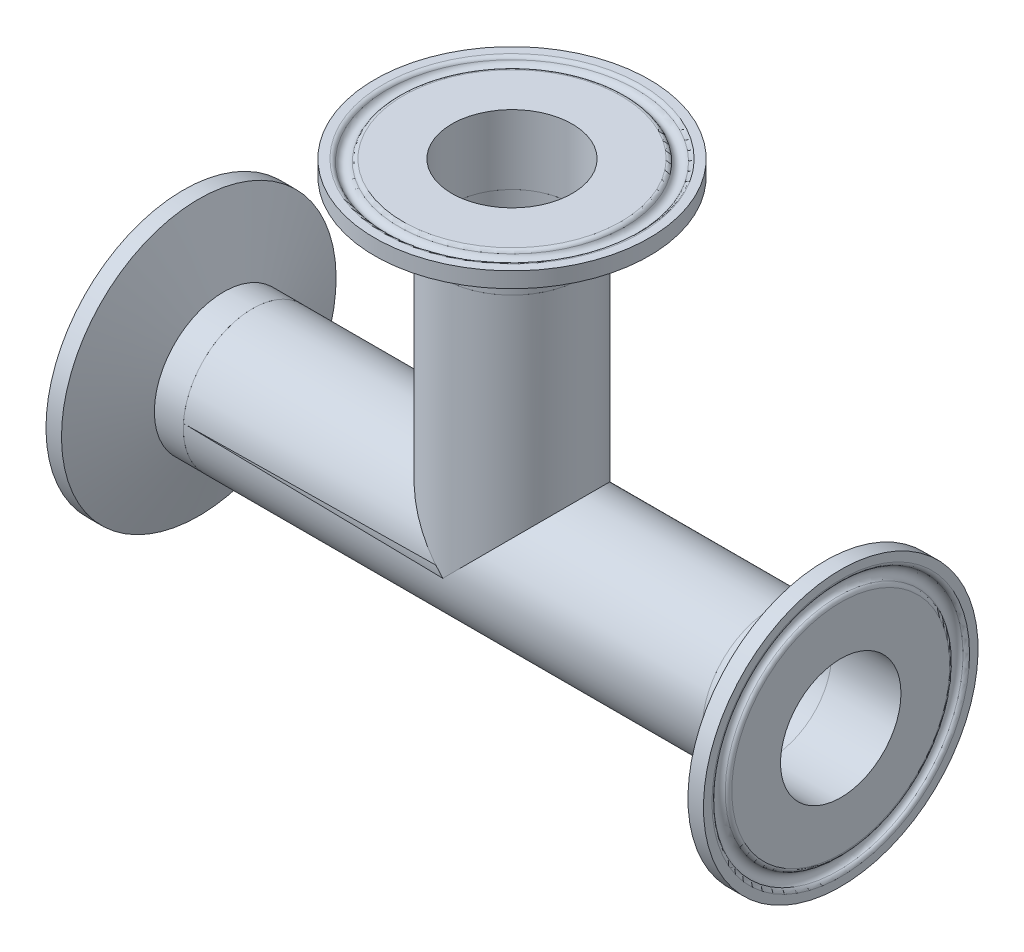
ISO-10303-21;
HEADER;
FILE_DESCRIPTION(('STEP AP214'),'2;1');
FILE_NAME('part.step','',(''),(''),'','','');
FILE_SCHEMA(('AUTOMOTIVE_DESIGN { 1 0 10303 214 1 1 1 1 }'));
ENDSEC;
DATA;
#1=APPLICATION_CONTEXT('core data for automotive mechanical design processes');
#2=APPLICATION_PROTOCOL_DEFINITION('international standard','automotive_design',2000,#1);
#3=PRODUCT_CONTEXT('',#1,'mechanical');
#4=PRODUCT('Part','Part','',(#3));
#5=PRODUCT_RELATED_PRODUCT_CATEGORY('part','',(#4));
#6=PRODUCT_DEFINITION_FORMATION('','',#4);
#7=PRODUCT_DEFINITION_CONTEXT('part definition',#1,'design');
#8=PRODUCT_DEFINITION('design','',#6,#7);
#9=PRODUCT_DEFINITION_SHAPE('','',#8);
#10=(LENGTH_UNIT() NAMED_UNIT(*) SI_UNIT(.MILLI.,.METRE.));
#11=(NAMED_UNIT(*) PLANE_ANGLE_UNIT() SI_UNIT($,.RADIAN.));
#12=(NAMED_UNIT(*) SI_UNIT($,.STERADIAN.) SOLID_ANGLE_UNIT());
#13=UNCERTAINTY_MEASURE_WITH_UNIT(LENGTH_MEASURE(1.E-05),#10,'distance_accuracy_value','');
#14=(GEOMETRIC_REPRESENTATION_CONTEXT(3) GLOBAL_UNCERTAINTY_ASSIGNED_CONTEXT((#13)) GLOBAL_UNIT_ASSIGNED_CONTEXT((#10,
#11,#12)) REPRESENTATION_CONTEXT('',''));
#15=CARTESIAN_POINT('',(0.,0.,0.));
#16=DIRECTION('',(0.,0.,1.));
#17=DIRECTION('',(1.,0.,0.));
#18=AXIS2_PLACEMENT_3D('',#15,#16,#17);
#19=CARTESIAN_POINT('',(96.6504004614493,40.8323307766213,78.3191987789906));
#20=DIRECTION('',(1.,0.,0.));
#21=DIRECTION('',(0.,-0.895671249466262,-0.44471677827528));
#22=AXIS2_PLACEMENT_3D('',#19,#20,#21);
#23=TOROIDAL_SURFACE('',#22,23.6366084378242,0.787399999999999);
#24=CARTESIAN_POINT('',(97.4378004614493,40.8323307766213,78.3191987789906));
#25=DIRECTION('',(1.,0.,0.));
#26=DIRECTION('',(0.,-0.895671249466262,-0.44471677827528));
#27=AXIS2_PLACEMENT_3D('',#24,#25,#26);
#28=CIRCLE('',#27,23.6366084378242);
#29=CARTESIAN_POINT('',(97.4378004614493,19.6617001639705,67.8076024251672));
#30=VERTEX_POINT('',#29);
#31=EDGE_CURVE('P0_E48',#30,#30,#28,.T.);
#32=ORIENTED_EDGE('',*,*,#31,.T.);
#33=EDGE_LOOP('',(#32));
#34=FACE_BOUND('',#33,.T.);
#35=CARTESIAN_POINT('',(96.9633414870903,40.8323307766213,78.3191987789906));
#36=DIRECTION('',(1.,0.,0.));
#37=DIRECTION('',(0.,-0.895671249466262,-0.44471677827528));
#38=AXIS2_PLACEMENT_3D('',#35,#36,#37);
#39=CIRCLE('',#38,22.9140666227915);
#40=CARTESIAN_POINT('',(96.9633414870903,20.3088600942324,68.1289288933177));
#41=VERTEX_POINT('',#40);
#42=EDGE_CURVE('P0_E9',#41,#41,#39,.T.);
#43=ORIENTED_EDGE('',*,*,#42,.F.);
#44=EDGE_LOOP('',(#43));
#45=FACE_BOUND('',#44,.T.);
#46=ADVANCED_FACE('P0_F14',(#34,#45),#23,.T.);
#47=CARTESIAN_POINT('',(97.4378004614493,40.8323307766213,78.3191987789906));
#48=DIRECTION('',(1.,0.,0.));
#49=DIRECTION('',(0.,-0.895671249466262,-0.44471677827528));
#50=AXIS2_PLACEMENT_3D('',#47,#48,#49);
#51=TOROIDAL_SURFACE('',#50,21.8186,1.1938);
#52=CARTESIAN_POINT('',(96.9633414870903,40.8323307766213,78.3191987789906));
#53=DIRECTION('',(1.,0.,0.));
#54=DIRECTION('',(0.,-0.895671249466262,-0.44471677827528));
#55=AXIS2_PLACEMENT_3D('',#52,#53,#54);
#56=CIRCLE('',#55,20.7231333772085);
#57=CARTESIAN_POINT('',(96.9633414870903,22.271216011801,69.1032736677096));
#58=VERTEX_POINT('',#57);
#59=EDGE_CURVE('P0_E20',#58,#58,#56,.T.);
#60=ORIENTED_EDGE('',*,*,#59,.F.);
#61=EDGE_LOOP('',(#60));
#62=FACE_BOUND('',#61,.T.);
#63=ORIENTED_EDGE('',*,*,#42,.T.);
#64=EDGE_LOOP('',(#63));
#65=FACE_BOUND('',#64,.T.);
#66=ADVANCED_FACE('P0_F97',(#62,#65),#51,.F.);
#67=CARTESIAN_POINT('',(96.6504004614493,40.8323307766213,78.3191987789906));
#68=DIRECTION('',(1.,0.,0.));
#69=DIRECTION('',(0.,-0.895671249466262,-0.44471677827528));
#70=AXIS2_PLACEMENT_3D('',#67,#68,#69);
#71=TOROIDAL_SURFACE('',#70,20.0005915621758,0.787399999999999);
#72=ORIENTED_EDGE('',*,*,#59,.T.);
#73=EDGE_LOOP('',(#72));
#74=FACE_BOUND('',#73,.T.);
#75=CARTESIAN_POINT('',(97.4378004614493,40.8323307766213,78.3191987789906));
#76=DIRECTION('',(1.,0.,0.));
#77=DIRECTION('',(0.,-0.895671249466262,-0.44471677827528));
#78=AXIS2_PLACEMENT_3D('',#75,#76,#77);
#79=CIRCLE('',#78,20.0005915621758);
#80=CARTESIAN_POINT('',(97.4378004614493,22.9183759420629,69.4246001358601));
#81=VERTEX_POINT('',#80);
#82=EDGE_CURVE('P0_E24',#81,#81,#79,.T.);
#83=ORIENTED_EDGE('',*,*,#82,.F.);
#84=EDGE_LOOP('',(#83));
#85=FACE_BOUND('',#84,.T.);
#86=ADVANCED_FACE('P0_F93',(#74,#85),#71,.T.);
#87=CARTESIAN_POINT('',(97.4378004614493,40.8323307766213,78.3191987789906));
#88=DIRECTION('',(-1.,0.,0.));
#89=DIRECTION('',(0.,0.895671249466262,0.44471677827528));
#90=AXIS2_PLACEMENT_3D('',#87,#88,#89);
#91=PLANE('',#90);
#92=CARTESIAN_POINT('',(97.4378004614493,40.8323307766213,78.3191987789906));
#93=DIRECTION('',(1.,0.,0.));
#94=DIRECTION('',(0.,-0.895671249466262,-0.44471677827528));
#95=AXIS2_PLACEMENT_3D('',#92,#93,#94);
#96=CIRCLE('',#95,11.049);
#97=CARTESIAN_POINT('',(97.4378004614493,30.9360591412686,73.4055230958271));
#98=VERTEX_POINT('',#97);
#99=EDGE_CURVE('P0_E28',#98,#98,#96,.T.);
#100=ORIENTED_EDGE('',*,*,#99,.F.);
#101=EDGE_LOOP('',(#100));
#102=FACE_BOUND('',#101,.T.);
#103=ORIENTED_EDGE('',*,*,#82,.T.);
#104=EDGE_LOOP('',(#103));
#105=FACE_BOUND('',#104,.T.);
#106=ADVANCED_FACE('P0_F86',(#102,#105),#91,.F.);
#107=CARTESIAN_POINT('',(97.4378004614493,40.8323307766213,78.3191987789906));
#108=DIRECTION('',(1.,0.,0.));
#109=DIRECTION('',(0.,-0.895671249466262,-0.44471677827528));
#110=AXIS2_PLACEMENT_3D('',#107,#108,#109);
#111=CYLINDRICAL_SURFACE('',#110,11.049);
#112=ORIENTED_EDGE('',*,*,#99,.T.);
#113=EDGE_LOOP('',(#112));
#114=FACE_BOUND('',#113,.T.);
#115=CARTESIAN_POINT('',(84.7378004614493,40.8323307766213,78.3191987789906));
#116=DIRECTION('',(1.,0.,0.));
#117=DIRECTION('',(0.,-0.895671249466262,-0.44471677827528));
#118=AXIS2_PLACEMENT_3D('',#115,#116,#117);
#119=CIRCLE('',#118,11.049);
#120=CARTESIAN_POINT('',(84.7378004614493,30.9360591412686,73.4055230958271));
#121=VERTEX_POINT('',#120);
#122=EDGE_CURVE('P0_E33',#121,#121,#119,.T.);
#123=ORIENTED_EDGE('',*,*,#122,.F.);
#124=EDGE_LOOP('',(#123));
#125=FACE_BOUND('',#124,.T.);
#126=ADVANCED_FACE('P0_F81',(#114,#125),#111,.F.);
#127=CARTESIAN_POINT('',(84.7378004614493,40.8323307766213,78.3191987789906));
#128=DIRECTION('',(1.,0.,0.));
#129=DIRECTION('',(0.,-0.895671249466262,-0.44471677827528));
#130=AXIS2_PLACEMENT_3D('',#127,#128,#129);
#131=PLANE('',#130);
#132=CARTESIAN_POINT('',(84.7378004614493,40.8323307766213,78.3191987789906));
#133=DIRECTION('',(1.,0.,0.));
#134=DIRECTION('',(0.,-0.895671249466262,-0.44471677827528));
#135=AXIS2_PLACEMENT_3D('',#132,#133,#134);
#136=CIRCLE('',#135,12.7);
#137=CARTESIAN_POINT('',(84.7378004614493,29.4573059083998,72.6712956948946));
#138=VERTEX_POINT('',#137);
#139=EDGE_CURVE('P0_E36',#138,#138,#136,.T.);
#140=ORIENTED_EDGE('',*,*,#139,.F.);
#141=EDGE_LOOP('',(#140));
#142=FACE_BOUND('',#141,.T.);
#143=ORIENTED_EDGE('',*,*,#122,.T.);
#144=EDGE_LOOP('',(#143));
#145=FACE_BOUND('',#144,.T.);
#146=ADVANCED_FACE('P0_F75',(#142,#145),#131,.F.);
#147=CARTESIAN_POINT('',(97.4378004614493,40.8323307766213,78.3191987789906));
#148=DIRECTION('',(1.,0.,0.));
#149=DIRECTION('',(0.,-0.895671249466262,-0.44471677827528));
#150=AXIS2_PLACEMENT_3D('',#147,#148,#149);
#151=CYLINDRICAL_SURFACE('',#150,12.7);
#152=CARTESIAN_POINT('',(90.0445372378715,40.8323307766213,78.3191987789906));
#153=DIRECTION('',(1.,0.,0.));
#154=DIRECTION('',(0.,-0.895671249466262,-0.44471677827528));
#155=AXIS2_PLACEMENT_3D('',#152,#153,#154);
#156=CIRCLE('',#155,12.7);
#157=CARTESIAN_POINT('',(90.0445372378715,29.4573059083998,72.6712956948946));
#158=VERTEX_POINT('',#157);
#159=EDGE_CURVE('P0_E39',#158,#158,#156,.T.);
#160=ORIENTED_EDGE('',*,*,#159,.F.);
#161=EDGE_LOOP('',(#160));
#162=FACE_BOUND('',#161,.T.);
#163=ORIENTED_EDGE('',*,*,#139,.T.);
#164=EDGE_LOOP('',(#163));
#165=FACE_BOUND('',#164,.T.);
#166=ADVANCED_FACE('P0_F69',(#162,#165),#151,.T.);
#167=CARTESIAN_POINT('',(90.0445372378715,40.8323307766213,78.3191987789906));
#168=DIRECTION('',(1.,0.,0.));
#169=DIRECTION('',(0.,-0.895671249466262,-0.44471677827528));
#170=AXIS2_PLACEMENT_3D('',#167,#168,#169);
#171=CONICAL_SURFACE('',#170,12.7,1.22173047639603);
#172=CARTESIAN_POINT('',(94.5930004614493,40.8323307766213,78.3191987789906));
#173=DIRECTION('',(1.,0.,0.));
#174=DIRECTION('',(0.,-0.895671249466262,-0.44471677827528));
#175=AXIS2_PLACEMENT_3D('',#172,#173,#174);
#176=CIRCLE('',#175,25.1968);
#177=CARTESIAN_POINT('',(94.5930004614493,18.2642814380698,67.1137590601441));
#178=VERTEX_POINT('',#177);
#179=EDGE_CURVE('P0_E42',#178,#178,#176,.T.);
#180=ORIENTED_EDGE('',*,*,#179,.F.);
#181=EDGE_LOOP('',(#180));
#182=FACE_BOUND('',#181,.T.);
#183=ORIENTED_EDGE('',*,*,#159,.T.);
#184=EDGE_LOOP('',(#183));
#185=FACE_BOUND('',#184,.T.);
#186=ADVANCED_FACE('P0_F63',(#182,#185),#171,.T.);
#187=CARTESIAN_POINT('',(97.4378004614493,40.8323307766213,78.3191987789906));
#188=DIRECTION('',(1.,0.,0.));
#189=DIRECTION('',(0.,-0.895671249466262,-0.44471677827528));
#190=AXIS2_PLACEMENT_3D('',#187,#188,#189);
#191=CYLINDRICAL_SURFACE('',#190,25.1968);
#192=CARTESIAN_POINT('',(97.4378004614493,40.8323307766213,78.3191987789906));
#193=DIRECTION('',(1.,0.,0.));
#194=DIRECTION('',(0.,-0.895671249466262,-0.44471677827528));
#195=AXIS2_PLACEMENT_3D('',#192,#193,#194);
#196=CIRCLE('',#195,25.1968);
#197=CARTESIAN_POINT('',(97.4378004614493,18.2642814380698,67.1137590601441));
#198=VERTEX_POINT('',#197);
#199=EDGE_CURVE('P0_E45',#198,#198,#196,.T.);
#200=ORIENTED_EDGE('',*,*,#199,.F.);
#201=EDGE_LOOP('',(#200));
#202=FACE_BOUND('',#201,.T.);
#203=ORIENTED_EDGE('',*,*,#179,.T.);
#204=EDGE_LOOP('',(#203));
#205=FACE_BOUND('',#204,.T.);
#206=ADVANCED_FACE('P0_F57',(#202,#205),#191,.T.);
#207=CARTESIAN_POINT('',(97.4378004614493,40.8323307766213,78.3191987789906));
#208=DIRECTION('',(-1.,0.,0.));
#209=DIRECTION('',(0.,0.895671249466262,0.44471677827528));
#210=AXIS2_PLACEMENT_3D('',#207,#208,#209);
#211=PLANE('',#210);
#212=ORIENTED_EDGE('',*,*,#31,.F.);
#213=EDGE_LOOP('',(#212));
#214=FACE_BOUND('',#213,.T.);
#215=ORIENTED_EDGE('',*,*,#199,.T.);
#216=EDGE_LOOP('',(#215));
#217=FACE_BOUND('',#216,.T.);
#218=ADVANCED_FACE('P0_F54',(#214,#217),#211,.F.);
#219=CLOSED_SHELL('',(#46,#66,#86,#106,#126,#146,#166,#186,#206,#218));
#220=MANIFOLD_SOLID_BREP('P0_B1',#219);
#221=CARTESIAN_POINT('',(37.1128004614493,100.369930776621,78.3191987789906));
#222=DIRECTION('',(0.,1.,0.));
#223=DIRECTION('',(0.902899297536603,0.,0.429852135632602));
#224=AXIS2_PLACEMENT_3D('',#221,#222,#223);
#225=TOROIDAL_SURFACE('',#224,23.6366084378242,0.787399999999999);
#226=CARTESIAN_POINT('',(37.1128004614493,101.157330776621,78.3191987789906));
#227=DIRECTION('',(0.,1.,0.));
#228=DIRECTION('',(0.902899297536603,0.,0.429852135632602));
#229=AXIS2_PLACEMENT_3D('',#226,#227,#228);
#230=CIRCLE('',#229,23.6366084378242);
#231=CARTESIAN_POINT('',(58.4542776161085,101.157330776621,88.479445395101));
#232=VERTEX_POINT('',#231);
#233=EDGE_CURVE('P1_E49',#232,#232,#230,.T.);
#234=ORIENTED_EDGE('',*,*,#233,.T.);
#235=EDGE_LOOP('',(#234));
#236=FACE_BOUND('',#235,.T.);
#237=CARTESIAN_POINT('',(37.1128004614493,100.682871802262,78.3191987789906));
#238=DIRECTION('',(0.,1.,0.));
#239=DIRECTION('',(0.902899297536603,0.,0.429852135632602));
#240=AXIS2_PLACEMENT_3D('',#237,#238,#239);
#241=CIRCLE('',#240,22.9140666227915);
#242=CARTESIAN_POINT('',(57.8018951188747,100.682871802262,88.1688592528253));
#243=VERTEX_POINT('',#242);
#244=EDGE_CURVE('P1_E10',#243,#243,#241,.T.);
#245=ORIENTED_EDGE('',*,*,#244,.F.);
#246=EDGE_LOOP('',(#245));
#247=FACE_BOUND('',#246,.T.);
#248=ADVANCED_FACE('P1_F15',(#236,#247),#225,.T.);
#249=CARTESIAN_POINT('',(37.1128004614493,101.157330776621,78.3191987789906));
#250=DIRECTION('',(0.,1.,0.));
#251=DIRECTION('',(0.902899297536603,0.,0.429852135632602));
#252=AXIS2_PLACEMENT_3D('',#249,#250,#251);
#253=TOROIDAL_SURFACE('',#252,21.8186,1.1938);
#254=CARTESIAN_POINT('',(37.1128004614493,100.682871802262,78.3191987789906));
#255=DIRECTION('',(0.,1.,0.));
#256=DIRECTION('',(0.902899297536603,0.,0.429852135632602));
#257=AXIS2_PLACEMENT_3D('',#254,#255,#256);
#258=CIRCLE('',#257,20.7231333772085);
#259=CARTESIAN_POINT('',(55.8237030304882,100.682871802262,87.227081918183));
#260=VERTEX_POINT('',#259);
#261=EDGE_CURVE('P1_E21',#260,#260,#258,.T.);
#262=ORIENTED_EDGE('',*,*,#261,.F.);
#263=EDGE_LOOP('',(#262));
#264=FACE_BOUND('',#263,.T.);
#265=ORIENTED_EDGE('',*,*,#244,.T.);
#266=EDGE_LOOP('',(#265));
#267=FACE_BOUND('',#266,.T.);
#268=ADVANCED_FACE('P1_F98',(#264,#267),#253,.F.);
#269=CARTESIAN_POINT('',(37.1128004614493,100.369930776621,78.3191987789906));
#270=DIRECTION('',(0.,1.,0.));
#271=DIRECTION('',(0.902899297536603,0.,0.429852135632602));
#272=AXIS2_PLACEMENT_3D('',#269,#270,#271);
#273=TOROIDAL_SURFACE('',#272,20.0005915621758,0.787399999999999);
#274=ORIENTED_EDGE('',*,*,#261,.T.);
#275=EDGE_LOOP('',(#274));
#276=FACE_BOUND('',#275,.T.);
#277=CARTESIAN_POINT('',(37.1128004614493,101.157330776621,78.3191987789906));
#278=DIRECTION('',(0.,1.,0.));
#279=DIRECTION('',(0.902899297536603,0.,0.429852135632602));
#280=AXIS2_PLACEMENT_3D('',#277,#278,#279);
#281=CIRCLE('',#280,20.0005915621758);
#282=CARTESIAN_POINT('',(55.1713205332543,101.157330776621,86.9164957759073));
#283=VERTEX_POINT('',#282);
#284=EDGE_CURVE('P1_E25',#283,#283,#281,.T.);
#285=ORIENTED_EDGE('',*,*,#284,.F.);
#286=EDGE_LOOP('',(#285));
#287=FACE_BOUND('',#286,.T.);
#288=ADVANCED_FACE('P1_F94',(#276,#287),#273,.T.);
#289=CARTESIAN_POINT('',(37.1128004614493,101.157330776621,78.3191987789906));
#290=DIRECTION('',(0.,-1.,0.));
#291=DIRECTION('',(-0.902899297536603,0.,-0.429852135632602));
#292=AXIS2_PLACEMENT_3D('',#289,#290,#291);
#293=PLANE('',#292);
#294=CARTESIAN_POINT('',(37.1128004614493,101.157330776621,78.3191987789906));
#295=DIRECTION('',(0.,1.,0.));
#296=DIRECTION('',(0.902899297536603,0.,0.429852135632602));
#297=AXIS2_PLACEMENT_3D('',#294,#295,#296);
#298=CIRCLE('',#297,11.049);
#299=CARTESIAN_POINT('',(47.0889347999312,101.157330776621,83.0686350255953));
#300=VERTEX_POINT('',#299);
#301=EDGE_CURVE('P1_E29',#300,#300,#298,.T.);
#302=ORIENTED_EDGE('',*,*,#301,.F.);
#303=EDGE_LOOP('',(#302));
#304=FACE_BOUND('',#303,.T.);
#305=ORIENTED_EDGE('',*,*,#284,.T.);
#306=EDGE_LOOP('',(#305));
#307=FACE_BOUND('',#306,.T.);
#308=ADVANCED_FACE('P1_F87',(#304,#307),#293,.F.);
#309=CARTESIAN_POINT('',(37.1128004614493,101.157330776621,78.3191987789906));
#310=DIRECTION('',(0.,1.,0.));
#311=DIRECTION('',(0.902899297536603,0.,0.429852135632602));
#312=AXIS2_PLACEMENT_3D('',#309,#310,#311);
#313=CYLINDRICAL_SURFACE('',#312,11.049);
#314=ORIENTED_EDGE('',*,*,#301,.T.);
#315=EDGE_LOOP('',(#314));
#316=FACE_BOUND('',#315,.T.);
#317=CARTESIAN_POINT('',(37.1128004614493,88.4573307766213,78.3191987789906));
#318=DIRECTION('',(0.,1.,0.));
#319=DIRECTION('',(0.902899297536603,0.,0.429852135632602));
#320=AXIS2_PLACEMENT_3D('',#317,#318,#319);
#321=CIRCLE('',#320,11.049);
#322=CARTESIAN_POINT('',(47.0889347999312,88.4573307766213,83.0686350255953));
#323=VERTEX_POINT('',#322);
#324=EDGE_CURVE('P1_E34',#323,#323,#321,.T.);
#325=ORIENTED_EDGE('',*,*,#324,.F.);
#326=EDGE_LOOP('',(#325));
#327=FACE_BOUND('',#326,.T.);
#328=ADVANCED_FACE('P1_F82',(#316,#327),#313,.F.);
#329=CARTESIAN_POINT('',(37.1128004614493,88.4573307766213,78.3191987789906));
#330=DIRECTION('',(0.,1.,0.));
#331=DIRECTION('',(0.902899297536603,0.,0.429852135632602));
#332=AXIS2_PLACEMENT_3D('',#329,#330,#331);
#333=PLANE('',#332);
#334=CARTESIAN_POINT('',(37.1128004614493,88.4573307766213,78.3191987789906));
#335=DIRECTION('',(0.,1.,0.));
#336=DIRECTION('',(0.902899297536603,0.,0.429852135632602));
#337=AXIS2_PLACEMENT_3D('',#334,#335,#336);
#338=CIRCLE('',#337,12.7);
#339=CARTESIAN_POINT('',(48.5796215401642,88.4573307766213,83.7783209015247));
#340=VERTEX_POINT('',#339);
#341=EDGE_CURVE('P1_E37',#340,#340,#338,.T.);
#342=ORIENTED_EDGE('',*,*,#341,.F.);
#343=EDGE_LOOP('',(#342));
#344=FACE_BOUND('',#343,.T.);
#345=ORIENTED_EDGE('',*,*,#324,.T.);
#346=EDGE_LOOP('',(#345));
#347=FACE_BOUND('',#346,.T.);
#348=ADVANCED_FACE('P1_F76',(#344,#347),#333,.F.);
#349=CARTESIAN_POINT('',(37.1128004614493,101.157330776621,78.3191987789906));
#350=DIRECTION('',(0.,1.,0.));
#351=DIRECTION('',(0.902899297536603,0.,0.429852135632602));
#352=AXIS2_PLACEMENT_3D('',#349,#350,#351);
#353=CYLINDRICAL_SURFACE('',#352,12.7);
#354=CARTESIAN_POINT('',(37.1128004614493,93.7640675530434,78.3191987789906));
#355=DIRECTION('',(0.,1.,0.));
#356=DIRECTION('',(0.902899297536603,0.,0.429852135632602));
#357=AXIS2_PLACEMENT_3D('',#354,#355,#356);
#358=CIRCLE('',#357,12.7);
#359=CARTESIAN_POINT('',(48.5796215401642,93.7640675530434,83.7783209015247));
#360=VERTEX_POINT('',#359);
#361=EDGE_CURVE('P1_E40',#360,#360,#358,.T.);
#362=ORIENTED_EDGE('',*,*,#361,.F.);
#363=EDGE_LOOP('',(#362));
#364=FACE_BOUND('',#363,.T.);
#365=ORIENTED_EDGE('',*,*,#341,.T.);
#366=EDGE_LOOP('',(#365));
#367=FACE_BOUND('',#366,.T.);
#368=ADVANCED_FACE('P1_F70',(#364,#367),#353,.T.);
#369=CARTESIAN_POINT('',(37.1128004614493,93.7640675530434,78.3191987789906));
#370=DIRECTION('',(0.,1.,0.));
#371=DIRECTION('',(0.902899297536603,0.,0.429852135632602));
#372=AXIS2_PLACEMENT_3D('',#369,#370,#371);
#373=CONICAL_SURFACE('',#372,12.7,1.22173047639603);
#374=CARTESIAN_POINT('',(37.1128004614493,98.3125307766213,78.3191987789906));
#375=DIRECTION('',(0.,1.,0.));
#376=DIRECTION('',(0.902899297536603,0.,0.429852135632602));
#377=AXIS2_PLACEMENT_3D('',#374,#375,#376);
#378=CIRCLE('',#377,25.1968);
#379=CARTESIAN_POINT('',(59.8629734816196,98.3125307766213,89.1500970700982));
#380=VERTEX_POINT('',#379);
#381=EDGE_CURVE('P1_E43',#380,#380,#378,.T.);
#382=ORIENTED_EDGE('',*,*,#381,.F.);
#383=EDGE_LOOP('',(#382));
#384=FACE_BOUND('',#383,.T.);
#385=ORIENTED_EDGE('',*,*,#361,.T.);
#386=EDGE_LOOP('',(#385));
#387=FACE_BOUND('',#386,.T.);
#388=ADVANCED_FACE('P1_F64',(#384,#387),#373,.T.);
#389=CARTESIAN_POINT('',(37.1128004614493,101.157330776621,78.3191987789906));
#390=DIRECTION('',(0.,1.,0.));
#391=DIRECTION('',(0.902899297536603,0.,0.429852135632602));
#392=AXIS2_PLACEMENT_3D('',#389,#390,#391);
#393=CYLINDRICAL_SURFACE('',#392,25.1968);
#394=CARTESIAN_POINT('',(37.1128004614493,101.157330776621,78.3191987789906));
#395=DIRECTION('',(0.,1.,0.));
#396=DIRECTION('',(0.902899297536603,0.,0.429852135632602));
#397=AXIS2_PLACEMENT_3D('',#394,#395,#396);
#398=CIRCLE('',#397,25.1968);
#399=CARTESIAN_POINT('',(59.8629734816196,101.157330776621,89.1500970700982));
#400=VERTEX_POINT('',#399);
#401=EDGE_CURVE('P1_E46',#400,#400,#398,.T.);
#402=ORIENTED_EDGE('',*,*,#401,.F.);
#403=EDGE_LOOP('',(#402));
#404=FACE_BOUND('',#403,.T.);
#405=ORIENTED_EDGE('',*,*,#381,.T.);
#406=EDGE_LOOP('',(#405));
#407=FACE_BOUND('',#406,.T.);
#408=ADVANCED_FACE('P1_F58',(#404,#407),#393,.T.);
#409=CARTESIAN_POINT('',(37.1128004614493,101.157330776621,78.3191987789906));
#410=DIRECTION('',(0.,-1.,0.));
#411=DIRECTION('',(-0.902899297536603,0.,-0.429852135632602));
#412=AXIS2_PLACEMENT_3D('',#409,#410,#411);
#413=PLANE('',#412);
#414=ORIENTED_EDGE('',*,*,#233,.F.);
#415=EDGE_LOOP('',(#414));
#416=FACE_BOUND('',#415,.T.);
#417=ORIENTED_EDGE('',*,*,#401,.T.);
#418=EDGE_LOOP('',(#417));
#419=FACE_BOUND('',#418,.T.);
#420=ADVANCED_FACE('P1_F55',(#416,#419),#413,.F.);
#421=CLOSED_SHELL('',(#248,#268,#288,#308,#328,#348,#368,#388,#408,#420));
#422=MANIFOLD_SOLID_BREP('P1_B1',#421);
#423=CARTESIAN_POINT('',(-22.4247995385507,40.8323307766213,78.3191987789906));
#424=DIRECTION('',(-1.,0.,0.));
#425=DIRECTION('',(0.,0.962040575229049,-0.272906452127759));
#426=AXIS2_PLACEMENT_3D('',#423,#424,#425);
#427=TOROIDAL_SURFACE('',#426,23.6366084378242,0.787399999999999);
#428=CARTESIAN_POINT('',(-23.2121995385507,40.8323307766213,78.3191987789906));
#429=DIRECTION('',(-1.,0.,0.));
#430=DIRECTION('',(0.,0.962040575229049,-0.272906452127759));
#431=AXIS2_PLACEMENT_3D('',#428,#429,#430);
#432=CIRCLE('',#431,23.6366084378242);
#433=CARTESIAN_POINT('',(-23.2121995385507,63.5717071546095,71.868615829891));
#434=VERTEX_POINT('',#433);
#435=EDGE_CURVE('P2_E49',#434,#434,#432,.T.);
#436=ORIENTED_EDGE('',*,*,#435,.T.);
#437=EDGE_LOOP('',(#436));
#438=FACE_BOUND('',#437,.T.);
#439=CARTESIAN_POINT('',(-22.7377405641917,40.8323307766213,78.3191987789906));
#440=DIRECTION('',(-1.,0.,0.));
#441=DIRECTION('',(0.,0.962040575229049,-0.272906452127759));
#442=AXIS2_PLACEMENT_3D('',#439,#440,#441);
#443=CIRCLE('',#442,22.9140666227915);
#444=CARTESIAN_POINT('',(-22.7377405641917,62.8765926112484,72.0658021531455));
#445=VERTEX_POINT('',#444);
#446=EDGE_CURVE('P2_E10',#445,#445,#443,.T.);
#447=ORIENTED_EDGE('',*,*,#446,.F.);
#448=EDGE_LOOP('',(#447));
#449=FACE_BOUND('',#448,.T.);
#450=ADVANCED_FACE('P2_F15',(#438,#449),#427,.T.);
#451=CARTESIAN_POINT('',(-23.2121995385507,40.8323307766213,78.3191987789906));
#452=DIRECTION('',(-1.,0.,0.));
#453=DIRECTION('',(0.,0.962040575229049,-0.272906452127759));
#454=AXIS2_PLACEMENT_3D('',#451,#452,#453);
#455=TOROIDAL_SURFACE('',#454,21.8186,1.1938);
#456=CARTESIAN_POINT('',(-22.7377405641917,40.8323307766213,78.3191987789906));
#457=DIRECTION('',(-1.,0.,0.));
#458=DIRECTION('',(0.,0.962040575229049,-0.272906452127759));
#459=AXIS2_PLACEMENT_3D('',#456,#457,#458);
#460=CIRCLE('',#459,20.7231333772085);
#461=CARTESIAN_POINT('',(-22.7377405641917,60.7688259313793,72.6637219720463));
#462=VERTEX_POINT('',#461);
#463=EDGE_CURVE('P2_E21',#462,#462,#460,.T.);
#464=ORIENTED_EDGE('',*,*,#463,.F.);
#465=EDGE_LOOP('',(#464));
#466=FACE_BOUND('',#465,.T.);
#467=ORIENTED_EDGE('',*,*,#446,.T.);
#468=EDGE_LOOP('',(#467));
#469=FACE_BOUND('',#468,.T.);
#470=ADVANCED_FACE('P2_F98',(#466,#469),#455,.F.);
#471=CARTESIAN_POINT('',(-22.4247995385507,40.8323307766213,78.3191987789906));
#472=DIRECTION('',(-1.,0.,0.));
#473=DIRECTION('',(0.,0.962040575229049,-0.272906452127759));
#474=AXIS2_PLACEMENT_3D('',#471,#472,#473);
#475=TOROIDAL_SURFACE('',#474,20.0005915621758,0.787399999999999);
#476=ORIENTED_EDGE('',*,*,#463,.T.);
#477=EDGE_LOOP('',(#476));
#478=FACE_BOUND('',#477,.T.);
#479=CARTESIAN_POINT('',(-23.2121995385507,40.8323307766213,78.3191987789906));
#480=DIRECTION('',(-1.,0.,0.));
#481=DIRECTION('',(0.,0.962040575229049,-0.272906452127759));
#482=AXIS2_PLACEMENT_3D('',#479,#480,#481);
#483=CIRCLE('',#482,20.0005915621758);
#484=CARTESIAN_POINT('',(-23.2121995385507,60.0737113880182,72.8609082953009));
#485=VERTEX_POINT('',#484);
#486=EDGE_CURVE('P2_E25',#485,#485,#483,.T.);
#487=ORIENTED_EDGE('',*,*,#486,.F.);
#488=EDGE_LOOP('',(#487));
#489=FACE_BOUND('',#488,.T.);
#490=ADVANCED_FACE('P2_F94',(#478,#489),#475,.T.);
#491=CARTESIAN_POINT('',(-23.2121995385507,40.8323307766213,78.3191987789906));
#492=DIRECTION('',(1.,0.,0.));
#493=DIRECTION('',(0.,-0.962040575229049,0.272906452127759));
#494=AXIS2_PLACEMENT_3D('',#491,#492,#493);
#495=PLANE('',#494);
#496=CARTESIAN_POINT('',(-23.2121995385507,40.8323307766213,78.3191987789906));
#497=DIRECTION('',(-1.,0.,0.));
#498=DIRECTION('',(0.,0.962040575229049,-0.272906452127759));
#499=AXIS2_PLACEMENT_3D('',#496,#497,#498);
#500=CIRCLE('',#499,11.049);
#501=CARTESIAN_POINT('',(-23.2121995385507,51.4619170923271,75.303855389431));
#502=VERTEX_POINT('',#501);
#503=EDGE_CURVE('P2_E29',#502,#502,#500,.T.);
#504=ORIENTED_EDGE('',*,*,#503,.F.);
#505=EDGE_LOOP('',(#504));
#506=FACE_BOUND('',#505,.T.);
#507=ORIENTED_EDGE('',*,*,#486,.T.);
#508=EDGE_LOOP('',(#507));
#509=FACE_BOUND('',#508,.T.);
#510=ADVANCED_FACE('P2_F87',(#506,#509),#495,.F.);
#511=CARTESIAN_POINT('',(-23.2121995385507,40.8323307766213,78.3191987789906));
#512=DIRECTION('',(-1.,0.,0.));
#513=DIRECTION('',(0.,0.962040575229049,-0.272906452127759));
#514=AXIS2_PLACEMENT_3D('',#511,#512,#513);
#515=CYLINDRICAL_SURFACE('',#514,11.049);
#516=ORIENTED_EDGE('',*,*,#503,.T.);
#517=EDGE_LOOP('',(#516));
#518=FACE_BOUND('',#517,.T.);
#519=CARTESIAN_POINT('',(-10.5121995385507,40.8323307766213,78.3191987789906));
#520=DIRECTION('',(-1.,0.,0.));
#521=DIRECTION('',(0.,0.962040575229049,-0.272906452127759));
#522=AXIS2_PLACEMENT_3D('',#519,#520,#521);
#523=CIRCLE('',#522,11.049);
#524=CARTESIAN_POINT('',(-10.5121995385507,51.4619170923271,75.303855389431));
#525=VERTEX_POINT('',#524);
#526=EDGE_CURVE('P2_E34',#525,#525,#523,.T.);
#527=ORIENTED_EDGE('',*,*,#526,.F.);
#528=EDGE_LOOP('',(#527));
#529=FACE_BOUND('',#528,.T.);
#530=ADVANCED_FACE('P2_F82',(#518,#529),#515,.F.);
#531=CARTESIAN_POINT('',(-10.5121995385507,40.8323307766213,78.3191987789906));
#532=DIRECTION('',(-1.,0.,0.));
#533=DIRECTION('',(0.,0.962040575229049,-0.272906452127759));
#534=AXIS2_PLACEMENT_3D('',#531,#532,#533);
#535=PLANE('',#534);
#536=CARTESIAN_POINT('',(-10.5121995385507,40.8323307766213,78.3191987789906));
#537=DIRECTION('',(-1.,0.,0.));
#538=DIRECTION('',(0.,0.962040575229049,-0.272906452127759));
#539=AXIS2_PLACEMENT_3D('',#536,#537,#538);
#540=CIRCLE('',#539,12.7);
#541=CARTESIAN_POINT('',(-10.5121995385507,53.0502460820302,74.8532868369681));
#542=VERTEX_POINT('',#541);
#543=EDGE_CURVE('P2_E37',#542,#542,#540,.T.);
#544=ORIENTED_EDGE('',*,*,#543,.F.);
#545=EDGE_LOOP('',(#544));
#546=FACE_BOUND('',#545,.T.);
#547=ORIENTED_EDGE('',*,*,#526,.T.);
#548=EDGE_LOOP('',(#547));
#549=FACE_BOUND('',#548,.T.);
#550=ADVANCED_FACE('P2_F76',(#546,#549),#535,.F.);
#551=CARTESIAN_POINT('',(-23.2121995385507,40.8323307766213,78.3191987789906));
#552=DIRECTION('',(-1.,0.,0.));
#553=DIRECTION('',(0.,0.962040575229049,-0.272906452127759));
#554=AXIS2_PLACEMENT_3D('',#551,#552,#553);
#555=CYLINDRICAL_SURFACE('',#554,12.7);
#556=CARTESIAN_POINT('',(-15.8189363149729,40.8323307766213,78.3191987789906));
#557=DIRECTION('',(-1.,0.,0.));
#558=DIRECTION('',(0.,0.962040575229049,-0.272906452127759));
#559=AXIS2_PLACEMENT_3D('',#556,#557,#558);
#560=CIRCLE('',#559,12.7);
#561=CARTESIAN_POINT('',(-15.8189363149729,53.0502460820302,74.8532868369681));
#562=VERTEX_POINT('',#561);
#563=EDGE_CURVE('P2_E40',#562,#562,#560,.T.);
#564=ORIENTED_EDGE('',*,*,#563,.F.);
#565=EDGE_LOOP('',(#564));
#566=FACE_BOUND('',#565,.T.);
#567=ORIENTED_EDGE('',*,*,#543,.T.);
#568=EDGE_LOOP('',(#567));
#569=FACE_BOUND('',#568,.T.);
#570=ADVANCED_FACE('P2_F70',(#566,#569),#555,.T.);
#571=CARTESIAN_POINT('',(-15.8189363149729,40.8323307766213,78.3191987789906));
#572=DIRECTION('',(-1.,0.,0.));
#573=DIRECTION('',(0.,0.962040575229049,-0.272906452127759));
#574=AXIS2_PLACEMENT_3D('',#571,#572,#573);
#575=CONICAL_SURFACE('',#574,12.7,1.22173047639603);
#576=CARTESIAN_POINT('',(-20.3673995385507,40.8323307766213,78.3191987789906));
#577=DIRECTION('',(-1.,0.,0.));
#578=DIRECTION('',(0.,0.962040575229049,-0.272906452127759));
#579=AXIS2_PLACEMENT_3D('',#576,#577,#578);
#580=CIRCLE('',#579,25.1968);
#581=CARTESIAN_POINT('',(-20.3673995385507,65.0726747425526,71.4428294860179));
#582=VERTEX_POINT('',#581);
#583=EDGE_CURVE('P2_E43',#582,#582,#580,.T.);
#584=ORIENTED_EDGE('',*,*,#583,.F.);
#585=EDGE_LOOP('',(#584));
#586=FACE_BOUND('',#585,.T.);
#587=ORIENTED_EDGE('',*,*,#563,.T.);
#588=EDGE_LOOP('',(#587));
#589=FACE_BOUND('',#588,.T.);
#590=ADVANCED_FACE('P2_F64',(#586,#589),#575,.T.);
#591=CARTESIAN_POINT('',(-23.2121995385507,40.8323307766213,78.3191987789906));
#592=DIRECTION('',(-1.,0.,0.));
#593=DIRECTION('',(0.,0.962040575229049,-0.272906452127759));
#594=AXIS2_PLACEMENT_3D('',#591,#592,#593);
#595=CYLINDRICAL_SURFACE('',#594,25.1968);
#596=CARTESIAN_POINT('',(-23.2121995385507,40.8323307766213,78.3191987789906));
#597=DIRECTION('',(-1.,0.,0.));
#598=DIRECTION('',(0.,0.962040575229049,-0.272906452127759));
#599=AXIS2_PLACEMENT_3D('',#596,#597,#598);
#600=CIRCLE('',#599,25.1968);
#601=CARTESIAN_POINT('',(-23.2121995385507,65.0726747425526,71.4428294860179));
#602=VERTEX_POINT('',#601);
#603=EDGE_CURVE('P2_E46',#602,#602,#600,.T.);
#604=ORIENTED_EDGE('',*,*,#603,.F.);
#605=EDGE_LOOP('',(#604));
#606=FACE_BOUND('',#605,.T.);
#607=ORIENTED_EDGE('',*,*,#583,.T.);
#608=EDGE_LOOP('',(#607));
#609=FACE_BOUND('',#608,.T.);
#610=ADVANCED_FACE('P2_F58',(#606,#609),#595,.T.);
#611=CARTESIAN_POINT('',(-23.2121995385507,40.8323307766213,78.3191987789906));
#612=DIRECTION('',(1.,0.,0.));
#613=DIRECTION('',(0.,-0.962040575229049,0.272906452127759));
#614=AXIS2_PLACEMENT_3D('',#611,#612,#613);
#615=PLANE('',#614);
#616=ORIENTED_EDGE('',*,*,#435,.F.);
#617=EDGE_LOOP('',(#616));
#618=FACE_BOUND('',#617,.T.);
#619=ORIENTED_EDGE('',*,*,#603,.T.);
#620=EDGE_LOOP('',(#619));
#621=FACE_BOUND('',#620,.T.);
#622=ADVANCED_FACE('P2_F55',(#618,#621),#615,.F.);
#623=CLOSED_SHELL('',(#450,#470,#490,#510,#530,#550,#570,#590,#610,#622));
#624=MANIFOLD_SOLID_BREP('P2_B1',#623);
#625=CARTESIAN_POINT('',(-10.5121995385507,40.8323307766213,78.3191987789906));
#626=DIRECTION('',(1.,0.,0.));
#627=DIRECTION('',(0.,0.,-1.));
#628=AXIS2_PLACEMENT_3D('',#625,#626,#627);
#629=CYLINDRICAL_SURFACE('',#628,12.7);
#630=CARTESIAN_POINT('',(84.7378004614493,40.8323307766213,78.3191987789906));
#631=DIRECTION('',(1.,0.,0.));
#632=DIRECTION('',(0.,0.,-1.));
#633=AXIS2_PLACEMENT_3D('',#630,#631,#632);
#634=CIRCLE('',#633,12.7);
#635=CARTESIAN_POINT('',(84.7378004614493,40.8323307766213,65.6191987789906));
#636=VERTEX_POINT('',#635);
#637=EDGE_CURVE('P3_E59',#636,#636,#634,.T.);
#638=ORIENTED_EDGE('',*,*,#637,.F.);
#639=EDGE_LOOP('',(#638));
#640=FACE_BOUND('',#639,.T.);
#641=CARTESIAN_POINT('',(-10.5121995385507,40.8323307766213,78.3191987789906));
#642=DIRECTION('',(1.,0.,0.));
#643=DIRECTION('',(0.,0.,-1.));
#644=AXIS2_PLACEMENT_3D('',#641,#642,#643);
#645=CIRCLE('',#644,12.7);
#646=CARTESIAN_POINT('',(-10.5121995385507,40.8323307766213,65.6191987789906));
#647=VERTEX_POINT('',#646);
#648=EDGE_CURVE('P3_E62',#647,#647,#645,.T.);
#649=ORIENTED_EDGE('',*,*,#648,.T.);
#650=EDGE_LOOP('',(#649));
#651=FACE_BOUND('',#650,.T.);
#652=CARTESIAN_POINT('',(37.1128004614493,40.8323307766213,78.3191987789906));
#653=DIRECTION('',(0.707106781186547,-0.707106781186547,0.));
#654=DIRECTION('',(-0.707106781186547,-0.707106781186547,0.));
#655=AXIS2_PLACEMENT_3D('',#652,#653,#654);
#656=ELLIPSE('',#655,17.9605122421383,12.7);
#657=CARTESIAN_POINT('',(37.1128004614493,40.8323307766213,91.0191987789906));
#658=VERTEX_POINT('',#657);
#659=CARTESIAN_POINT('',(37.1128004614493,40.8323307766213,65.6191987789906));
#660=VERTEX_POINT('',#659);
#661=EDGE_CURVE('P3_E25',#658,#660,#656,.F.);
#662=ORIENTED_EDGE('',*,*,#661,.F.);
#663=CARTESIAN_POINT('',(37.1128004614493,40.8323307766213,78.3191987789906));
#664=DIRECTION('',(-0.707106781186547,-0.707106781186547,0.));
#665=DIRECTION('',(0.707106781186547,-0.707106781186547,0.));
#666=AXIS2_PLACEMENT_3D('',#663,#664,#665);
#667=ELLIPSE('',#666,17.9605122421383,12.7);
#668=EDGE_CURVE('P3_E65',#660,#658,#667,.F.);
#669=ORIENTED_EDGE('',*,*,#668,.F.);
#670=EDGE_LOOP('',(#662,#669));
#671=FACE_BOUND('',#670,.T.);
#672=ADVANCED_FACE('P3_F17',(#640,#651,#671),#629,.T.);
#673=CARTESIAN_POINT('',(-10.5121995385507,40.8323307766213,78.3191987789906));
#674=DIRECTION('',(1.,0.,0.));
#675=DIRECTION('',(0.,0.,-1.));
#676=AXIS2_PLACEMENT_3D('',#673,#674,#675);
#677=PLANE('',#676);
#678=CARTESIAN_POINT('',(-10.5121995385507,40.8323307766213,78.3191987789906));
#679=DIRECTION('',(1.,0.,0.));
#680=DIRECTION('',(0.,0.,-1.));
#681=AXIS2_PLACEMENT_3D('',#678,#679,#680);
#682=CIRCLE('',#681,11.049);
#683=CARTESIAN_POINT('',(-10.5121995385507,40.8323307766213,67.2701987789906));
#684=VERTEX_POINT('',#683);
#685=EDGE_CURVE('P3_E50',#684,#684,#682,.F.);
#686=ORIENTED_EDGE('',*,*,#685,.F.);
#687=EDGE_LOOP('',(#686));
#688=FACE_BOUND('',#687,.T.);
#689=ORIENTED_EDGE('',*,*,#648,.F.);
#690=EDGE_LOOP('',(#689));
#691=FACE_BOUND('',#690,.T.);
#692=ADVANCED_FACE('P3_F68',(#688,#691),#677,.F.);
#693=CARTESIAN_POINT('',(84.7378004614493,40.8323307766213,78.3191987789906));
#694=DIRECTION('',(1.,0.,0.));
#695=DIRECTION('',(0.,0.,-1.));
#696=AXIS2_PLACEMENT_3D('',#693,#694,#695);
#697=PLANE('',#696);
#698=CARTESIAN_POINT('',(84.7378004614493,40.8323307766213,78.3191987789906));
#699=DIRECTION('',(1.,0.,0.));
#700=DIRECTION('',(0.,0.,-1.));
#701=AXIS2_PLACEMENT_3D('',#698,#699,#700);
#702=CIRCLE('',#701,11.049);
#703=CARTESIAN_POINT('',(84.7378004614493,40.8323307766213,67.2701987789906));
#704=VERTEX_POINT('',#703);
#705=EDGE_CURVE('P3_E46',#704,#704,#702,.T.);
#706=ORIENTED_EDGE('',*,*,#705,.F.);
#707=EDGE_LOOP('',(#706));
#708=FACE_BOUND('',#707,.T.);
#709=ORIENTED_EDGE('',*,*,#637,.T.);
#710=EDGE_LOOP('',(#709));
#711=FACE_BOUND('',#710,.T.);
#712=ADVANCED_FACE('P3_F75',(#708,#711),#697,.T.);
#713=CARTESIAN_POINT('',(37.1128004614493,88.4573307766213,78.3191987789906));
#714=DIRECTION('',(0.,-1.,0.));
#715=DIRECTION('',(0.,0.,-1.));
#716=AXIS2_PLACEMENT_3D('',#713,#714,#715);
#717=CYLINDRICAL_SURFACE('',#716,12.7);
#718=CARTESIAN_POINT('',(37.1128004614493,88.4573307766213,78.3191987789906));
#719=DIRECTION('',(0.,1.,0.));
#720=DIRECTION('',(0.,0.,1.));
#721=AXIS2_PLACEMENT_3D('',#718,#719,#720);
#722=CIRCLE('',#721,12.7);
#723=CARTESIAN_POINT('',(37.1128004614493,88.4573307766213,91.0191987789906));
#724=VERTEX_POINT('',#723);
#725=EDGE_CURVE('P3_E11',#724,#724,#722,.T.);
#726=ORIENTED_EDGE('',*,*,#725,.F.);
#727=EDGE_LOOP('',(#726));
#728=FACE_BOUND('',#727,.T.);
#729=ORIENTED_EDGE('',*,*,#668,.T.);
#730=ORIENTED_EDGE('',*,*,#661,.T.);
#731=EDGE_LOOP('',(#729,#730));
#732=FACE_BOUND('',#731,.T.);
#733=ADVANCED_FACE('P3_F19',(#728,#732),#717,.T.);
#734=CARTESIAN_POINT('',(37.1128004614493,88.4573307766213,78.3191987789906));
#735=DIRECTION('',(0.,1.,0.));
#736=DIRECTION('',(0.,0.,1.));
#737=AXIS2_PLACEMENT_3D('',#734,#735,#736);
#738=PLANE('',#737);
#739=CARTESIAN_POINT('',(37.1128004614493,88.4573307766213,78.3191987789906));
#740=DIRECTION('',(0.,1.,0.));
#741=DIRECTION('',(0.,0.,1.));
#742=AXIS2_PLACEMENT_3D('',#739,#740,#741);
#743=CIRCLE('',#742,11.049);
#744=CARTESIAN_POINT('',(37.1128004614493,88.4573307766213,89.3681987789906));
#745=VERTEX_POINT('',#744);
#746=EDGE_CURVE('P3_E53',#745,#745,#743,.T.);
#747=ORIENTED_EDGE('',*,*,#746,.F.);
#748=EDGE_LOOP('',(#747));
#749=FACE_BOUND('',#748,.T.);
#750=ORIENTED_EDGE('',*,*,#725,.T.);
#751=EDGE_LOOP('',(#750));
#752=FACE_BOUND('',#751,.T.);
#753=ADVANCED_FACE('P3_F81',(#749,#752),#738,.T.);
#754=CARTESIAN_POINT('',(37.1128004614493,40.8323307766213,78.3191987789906));
#755=DIRECTION('',(0.,1.,0.));
#756=DIRECTION('',(0.,0.,1.));
#757=AXIS2_PLACEMENT_3D('',#754,#755,#756);
#758=CYLINDRICAL_SURFACE('',#757,11.049);
#759=CARTESIAN_POINT('',(37.1128004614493,40.8323307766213,78.3191987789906));
#760=DIRECTION('',(0.707106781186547,-0.707106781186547,0.));
#761=DIRECTION('',(0.707106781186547,0.707106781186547,0.));
#762=AXIS2_PLACEMENT_3D('',#759,#760,#761);
#763=ELLIPSE('',#762,15.6256456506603,11.049);
#764=CARTESIAN_POINT('',(37.1128004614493,40.8323307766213,89.3681987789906));
#765=VERTEX_POINT('',#764);
#766=CARTESIAN_POINT('',(37.1128004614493,40.8323307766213,67.2701987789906));
#767=VERTEX_POINT('',#766);
#768=EDGE_CURVE('P3_E42',#765,#767,#763,.F.);
#769=ORIENTED_EDGE('',*,*,#768,.F.);
#770=CARTESIAN_POINT('',(37.1128004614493,40.8323307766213,78.3191987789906));
#771=DIRECTION('',(0.707106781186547,0.707106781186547,0.));
#772=DIRECTION('',(0.707106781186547,-0.707106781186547,0.));
#773=AXIS2_PLACEMENT_3D('',#770,#771,#772);
#774=ELLIPSE('',#773,15.6256456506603,11.049);
#775=EDGE_CURVE('P3_E31',#767,#765,#774,.T.);
#776=ORIENTED_EDGE('',*,*,#775,.F.);
#777=EDGE_LOOP('',(#769,#776));
#778=FACE_BOUND('',#777,.T.);
#779=ORIENTED_EDGE('',*,*,#746,.T.);
#780=EDGE_LOOP('',(#779));
#781=FACE_BOUND('',#780,.T.);
#782=ADVANCED_FACE('P3_F48',(#778,#781),#758,.F.);
#783=CARTESIAN_POINT('',(-10.5131995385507,40.8323307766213,78.3191987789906));
#784=DIRECTION('',(1.,0.,0.));
#785=DIRECTION('',(0.,0.,-1.));
#786=AXIS2_PLACEMENT_3D('',#783,#784,#785);
#787=CYLINDRICAL_SURFACE('',#786,11.049);
#788=ORIENTED_EDGE('',*,*,#775,.T.);
#789=ORIENTED_EDGE('',*,*,#768,.T.);
#790=EDGE_LOOP('',(#788,#789));
#791=FACE_BOUND('',#790,.T.);
#792=ORIENTED_EDGE('',*,*,#705,.T.);
#793=EDGE_LOOP('',(#792));
#794=FACE_BOUND('',#793,.T.);
#795=ORIENTED_EDGE('',*,*,#685,.T.);
#796=EDGE_LOOP('',(#795));
#797=FACE_BOUND('',#796,.T.);
#798=ADVANCED_FACE('P3_F43',(#791,#794,#797),#787,.F.);
#799=CLOSED_SHELL('',(#672,#692,#712,#733,#753,#782,#798));
#800=MANIFOLD_SOLID_BREP('P3_B1',#799);
#801=ADVANCED_BREP_SHAPE_REPRESENTATION('',(#18,#220,#422,#624,#800),#14);
#802=SHAPE_DEFINITION_REPRESENTATION(#9,#801);
ENDSEC;
END-ISO-10303-21;
